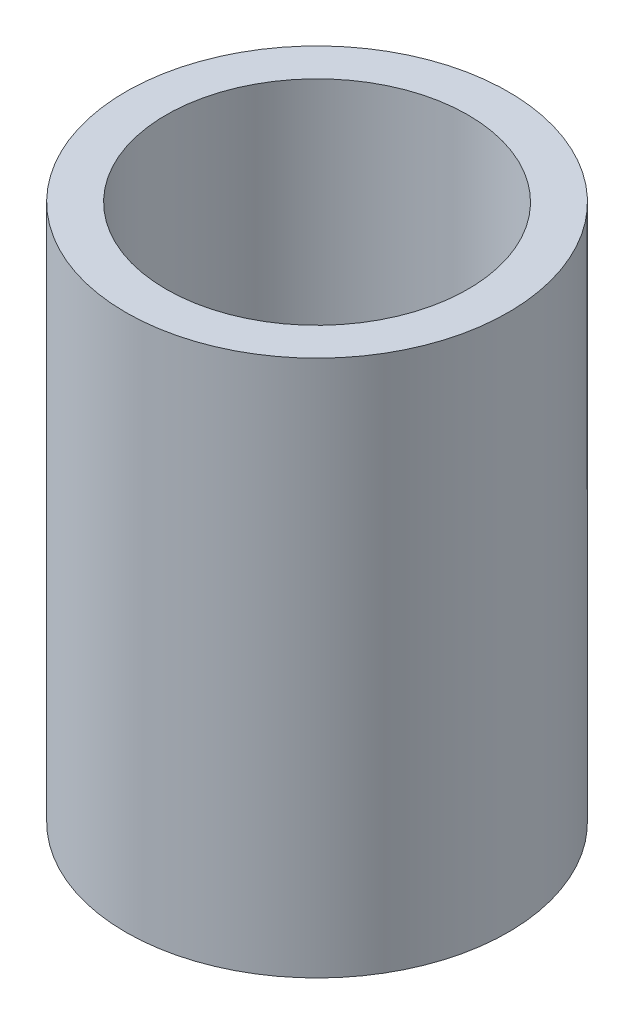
ISO-10303-21;
HEADER;
FILE_DESCRIPTION(('STEP AP214'),'2;1');
FILE_NAME('part.step','',(''),(''),'','','');
FILE_SCHEMA(('AUTOMOTIVE_DESIGN { 1 0 10303 214 1 1 1 1 }'));
ENDSEC;
DATA;
#1=APPLICATION_CONTEXT('core data for automotive mechanical design processes');
#2=APPLICATION_PROTOCOL_DEFINITION('international standard','automotive_design',2000,#1);
#3=PRODUCT_CONTEXT('',#1,'mechanical');
#4=PRODUCT('Part','Part','',(#3));
#5=PRODUCT_RELATED_PRODUCT_CATEGORY('part','',(#4));
#6=PRODUCT_DEFINITION_FORMATION('','',#4);
#7=PRODUCT_DEFINITION_CONTEXT('part definition',#1,'design');
#8=PRODUCT_DEFINITION('design','',#6,#7);
#9=PRODUCT_DEFINITION_SHAPE('','',#8);
#10=(LENGTH_UNIT() NAMED_UNIT(*) SI_UNIT(.MILLI.,.METRE.));
#11=(NAMED_UNIT(*) PLANE_ANGLE_UNIT() SI_UNIT($,.RADIAN.));
#12=(NAMED_UNIT(*) SI_UNIT($,.STERADIAN.) SOLID_ANGLE_UNIT());
#13=UNCERTAINTY_MEASURE_WITH_UNIT(LENGTH_MEASURE(1.E-05),#10,'distance_accuracy_value','');
#14=(GEOMETRIC_REPRESENTATION_CONTEXT(3) GLOBAL_UNCERTAINTY_ASSIGNED_CONTEXT((#13)) GLOBAL_UNIT_ASSIGNED_CONTEXT((#10,
#11,#12)) REPRESENTATION_CONTEXT('',''));
#15=CARTESIAN_POINT('',(0.,0.,0.));
#16=DIRECTION('',(0.,0.,1.));
#17=DIRECTION('',(1.,0.,0.));
#18=AXIS2_PLACEMENT_3D('',#15,#16,#17);
#19=CARTESIAN_POINT('',(0.,4.064,0.));
#20=DIRECTION('',(0.,1.,0.));
#21=DIRECTION('',(0.,0.,1.));
#22=AXIS2_PLACEMENT_3D('',#19,#20,#21);
#23=PLANE('',#22);
#24=CARTESIAN_POINT('',(0.,4.064,0.));
#25=DIRECTION('',(0.,1.,0.));
#26=DIRECTION('',(0.,0.,1.));
#27=AXIS2_PLACEMENT_3D('',#24,#25,#26);
#28=CIRCLE('',#27,1.4478);
#29=CARTESIAN_POINT('',(0.,4.064,1.4478));
#30=VERTEX_POINT('',#29);
#31=EDGE_CURVE('E10',#30,#30,#28,.T.);
#32=ORIENTED_EDGE('',*,*,#31,.T.);
#33=EDGE_LOOP('',(#32));
#34=FACE_BOUND('',#33,.T.);
#35=CARTESIAN_POINT('',(0.,4.064,0.));
#36=DIRECTION('',(0.,1.,0.));
#37=DIRECTION('',(0.,0.,1.));
#38=AXIS2_PLACEMENT_3D('',#35,#36,#37);
#39=CIRCLE('',#38,1.143);
#40=CARTESIAN_POINT('',(0.,4.064,1.143));
#41=VERTEX_POINT('',#40);
#42=EDGE_CURVE('E42',#41,#41,#39,.T.);
#43=ORIENTED_EDGE('',*,*,#42,.F.);
#44=EDGE_LOOP('',(#43));
#45=FACE_BOUND('',#44,.T.);
#46=ADVANCED_FACE('F31',(#34,#45),#23,.T.);
#47=CARTESIAN_POINT('',(0.,0.,0.));
#48=DIRECTION('',(0.,1.,0.));
#49=DIRECTION('',(0.,0.,1.));
#50=AXIS2_PLACEMENT_3D('',#47,#48,#49);
#51=PLANE('',#50);
#52=CARTESIAN_POINT('',(0.,0.,0.));
#53=DIRECTION('',(0.,1.,0.));
#54=DIRECTION('',(0.,0.,1.));
#55=AXIS2_PLACEMENT_3D('',#52,#53,#54);
#56=CIRCLE('',#55,1.4478);
#57=CARTESIAN_POINT('',(0.,0.,1.4478));
#58=VERTEX_POINT('',#57);
#59=EDGE_CURVE('E35',#58,#58,#56,.T.);
#60=ORIENTED_EDGE('',*,*,#59,.F.);
#61=EDGE_LOOP('',(#60));
#62=FACE_BOUND('',#61,.T.);
#63=CARTESIAN_POINT('',(0.,0.,0.));
#64=DIRECTION('',(0.,1.,0.));
#65=DIRECTION('',(0.,0.,1.));
#66=AXIS2_PLACEMENT_3D('',#63,#64,#65);
#67=CIRCLE('',#66,1.143);
#68=CARTESIAN_POINT('',(0.,0.,1.143));
#69=VERTEX_POINT('',#68);
#70=EDGE_CURVE('E44',#69,#69,#67,.T.);
#71=ORIENTED_EDGE('',*,*,#70,.T.);
#72=EDGE_LOOP('',(#71));
#73=FACE_BOUND('',#72,.T.);
#74=ADVANCED_FACE('F54',(#62,#73),#51,.F.);
#75=CARTESIAN_POINT('',(0.,4.064,0.));
#76=DIRECTION('',(0.,-1.,0.));
#77=DIRECTION('',(0.,0.,-1.));
#78=AXIS2_PLACEMENT_3D('',#75,#76,#77);
#79=CYLINDRICAL_SURFACE('',#78,1.4478);
#80=ORIENTED_EDGE('',*,*,#31,.F.);
#81=EDGE_LOOP('',(#80));
#82=FACE_BOUND('',#81,.T.);
#83=ORIENTED_EDGE('',*,*,#59,.T.);
#84=EDGE_LOOP('',(#83));
#85=FACE_BOUND('',#84,.T.);
#86=ADVANCED_FACE('F33',(#82,#85),#79,.T.);
#87=CARTESIAN_POINT('',(0.,4.064,0.));
#88=DIRECTION('',(0.,-1.,0.));
#89=DIRECTION('',(0.,0.,-1.));
#90=AXIS2_PLACEMENT_3D('',#87,#88,#89);
#91=CYLINDRICAL_SURFACE('',#90,1.143);
#92=ORIENTED_EDGE('',*,*,#42,.T.);
#93=EDGE_LOOP('',(#92));
#94=FACE_BOUND('',#93,.T.);
#95=ORIENTED_EDGE('',*,*,#70,.F.);
#96=EDGE_LOOP('',(#95));
#97=FACE_BOUND('',#96,.T.);
#98=ADVANCED_FACE('F50',(#94,#97),#91,.F.);
#99=CLOSED_SHELL('',(#46,#74,#86,#98));
#100=MANIFOLD_SOLID_BREP('B2',#99);
#101=ADVANCED_BREP_SHAPE_REPRESENTATION('',(#18,#100),#14);
#102=SHAPE_DEFINITION_REPRESENTATION(#9,#101);
ENDSEC;
END-ISO-10303-21;
